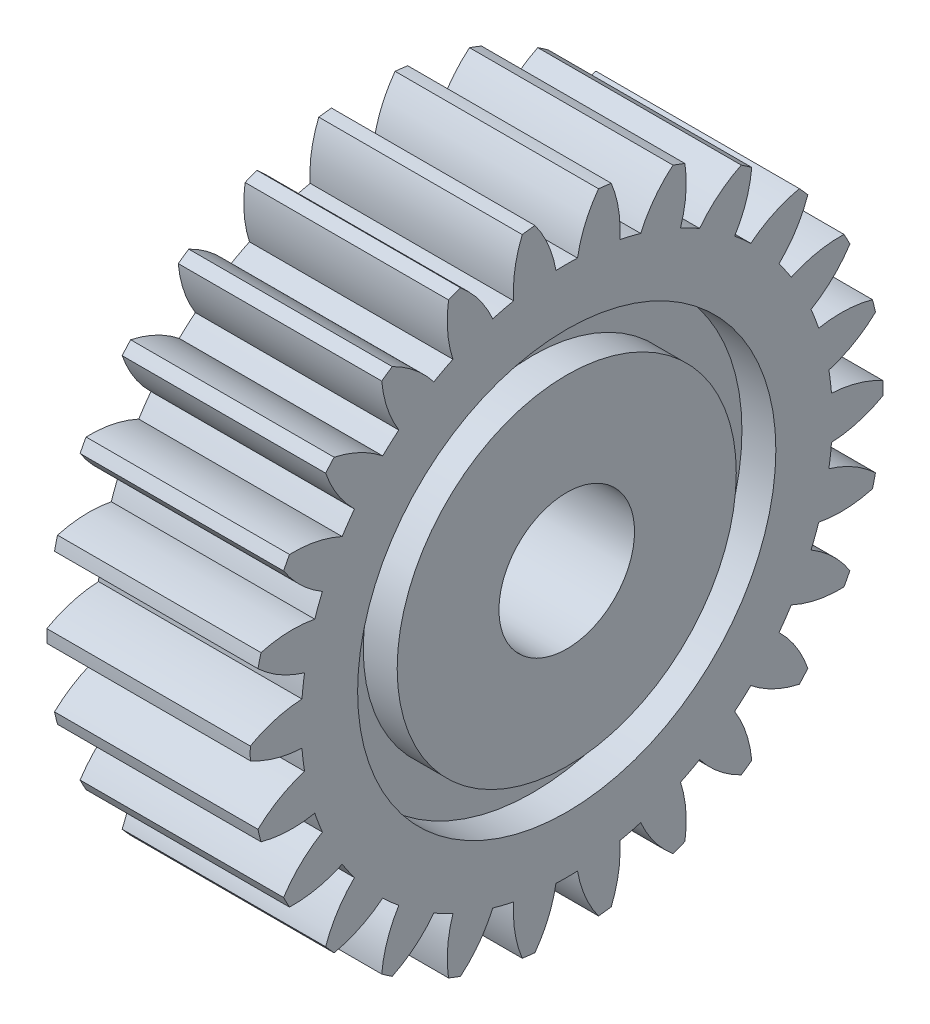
from build123d import *

# Parameters (mm, degrees)
BASPROSKE_W             = 9
BASPROSKE_H             = 14
TOOTHCUT_DEPTH          = 22.748563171
TEETHCUTS_COUNT         = 26
TEETHCUTS_ANGLE         = 346.153846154
HUBNEAONESKE_R          = 7.5
HUBNEARONE_DEPTH        = 9.0000508
BORSKE_R                = 3
BORE_DEPTH              = 18.0000508
CUT_EXTRUDE1_DEPTH      = 22.703049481
CUT_EXTRUDE1_DEPTH_BACK = 22.703049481
SKETCH1_W               = 9.0000508
SKETCH1_H               = 15.02384493
SKETCH2_R               = 9.25
SKETCH2_R_2             = 7.5
CUT_EXTRUDE2_DEPTH      = 1.5
CUT_EXTRUDE3_START      = -7.5
SKETCH2_2_R             = 9.25
SKETCH2_2_R_2           = 7.5
CUT_EXTRUDE3_DEPTH      = 1.5


with BuildPart() as part:
    # BasProSke → Base-Revolve (revolve)
    with BuildSketch(Plane(origin=(0, 0, 0), x_dir=(1, 0, 0), z_dir=(0, 1, 0)), mode=Mode.PRIVATE) as base_revolve_sk:
        with Locations((4.5, 7)):
            Rectangle(BASPROSKE_W, BASPROSKE_H)
    revolve(base_revolve_sk.sketch.rotate(Axis((-10, 0, 0), (1, 0, 0)), 180), axis=Axis((-10, 0, 0), (1, 0, 0)))

    # TooCutSke → ToothCut (cut, through all)
    with BuildSketch(Plane(origin=(0, 0, 0), x_dir=(0, 0, -1), z_dir=(1, 0, 0))):
        with BuildLine():
            ThreePointArc((0.476965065, 11.739314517), (0, 11.749), (-0.476965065, 11.739314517))
            ThreePointArc((-0.476965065, 11.739314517), (-0.82065865, 12.901686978), (-1.424117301, 13.952911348))
            ThreePointArc((-1.424117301, 13.952911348), (0, 14.0254), (1.424117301, 13.952911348))
            ThreePointArc((1.424117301, 13.952911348), (0.82065865, 12.901686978), (0.476965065, 11.739314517))
        make_face()
    toothcut = extrude(amount=TOOTHCUT_DEPTH, mode=Mode.SUBTRACT)

    # TeethCuts: ToothCut ×26 about axis
    teethcuts_axis = Axis((-10, 0, 0), (1, 0, 0))
    for i in range(1, TEETHCUTS_COUNT):
        add(toothcut.rotate(teethcuts_axis, i * TEETHCUTS_ANGLE / (TEETHCUTS_COUNT - 1)), mode=Mode.SUBTRACT)

    # HubNeaOneSke → HubNearOne (add)
    with BuildSketch(Plane.ZY):
        with Locations(Location((0, 0, 0), (0, 0, 180))):
            Circle(HUBNEAONESKE_R)
    extrude(amount=HUBNEARONE_DEPTH)

    # BorSke → Bore (cut, symmetric)
    with BuildSketch(Plane(origin=(0, 0, 0), x_dir=(0, 0, -1), z_dir=(1, 0, 0))):
        with Locations(Location((0, 0, 0), (0, 0, 180))):
            Circle(BORSKE_R)
    extrude(amount=BORE_DEPTH, both=True, mode=Mode.SUBTRACT)

    # Sketch1 → Cut-Extrude1 (cut, two sides: drawn at the far end of the back side and taken through both)
    with BuildSketch(Plane.XY.offset(-CUT_EXTRUDE1_DEPTH_BACK)):
        with Locations((-4.5000254, -0.011922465)):
            Rectangle(SKETCH1_W, SKETCH1_H)
    extrude(amount=CUT_EXTRUDE1_DEPTH + CUT_EXTRUDE1_DEPTH_BACK, mode=Mode.SUBTRACT)

    # Sketch2 → Cut-Extrude2 (cut)
    with BuildSketch(Plane(origin=(9, 0, 0), x_dir=(0, 0, -1), z_dir=(1, 0, 0))):
        Circle(SKETCH2_R)
        Circle(SKETCH2_R_2, mode=Mode.SUBTRACT)
    extrude(amount=-CUT_EXTRUDE2_DEPTH, mode=Mode.SUBTRACT)

    # Sketch2_2 → Cut-Extrude3 (cut)
    with BuildSketch(Plane(origin=(9, 0, 0), x_dir=(0, 0, -1), z_dir=(1, 0, 0)).offset(CUT_EXTRUDE3_START)):
        Circle(SKETCH2_2_R)
        Circle(SKETCH2_2_R_2, mode=Mode.SUBTRACT)
    extrude(amount=-CUT_EXTRUDE3_DEPTH, mode=Mode.SUBTRACT)


solid = part.part
